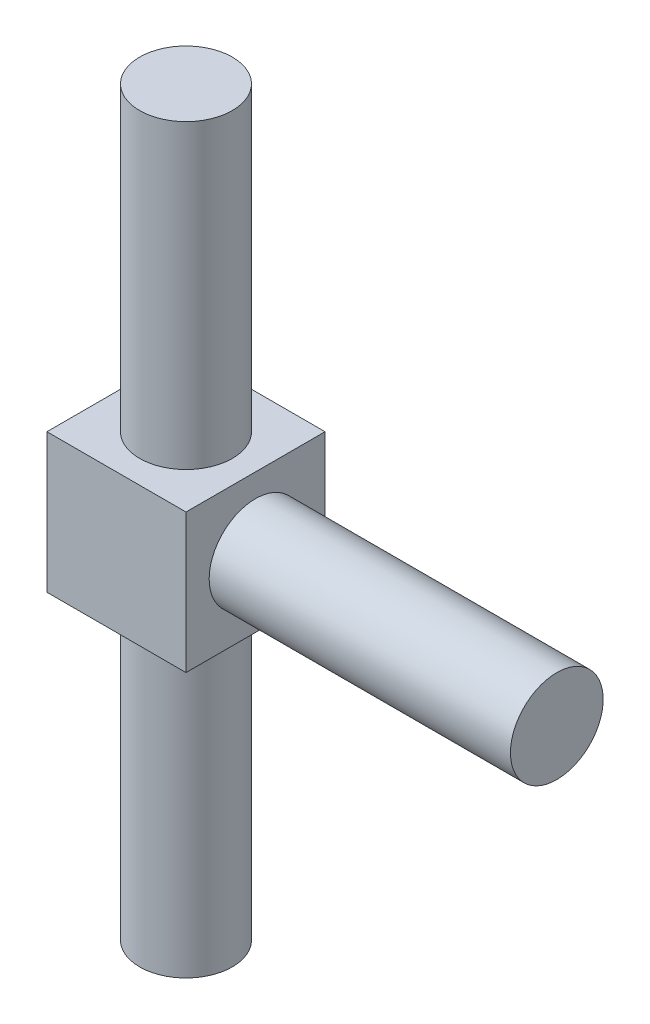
from build123d import *

# Parameters (mm, degrees)
SKETCH_1_W      = 6
SKETCH_1_H      = 6
EXTRUDE_1_DEPTH = 6
SKETCH_2_R      = 2
EXTRUDE_2_DEPTH = 13
EXTRUDE_START   = 13
EXTRUDE_3_DEPTH = 13
EXTRUDE_4_DEPTH = 13


with BuildPart() as part:
    # Sketch 1 → Extrude 1 (new body)
    with BuildSketch(Plane(origin=(0, 0, 0), x_dir=(1, 0, 0), z_dir=(0, 1, 0))):
        with Locations((3, 3)):
            Rectangle(SKETCH_1_W, SKETCH_1_H)
    extrude(amount=EXTRUDE_1_DEPTH)

    # Sketch 2 → Extrude 2 (add)
    with BuildSketch(Plane(origin=(0, 6, 0), x_dir=(1, 0, 0), z_dir=(0, 1, 0))):
        with Locations(Location((3, 3, 0), (0, 0, 90))):
            Circle(SKETCH_2_R)
    extrude(amount=EXTRUDE_2_DEPTH)

    # Sketch 3 → Extrude 3 (add)
    with BuildSketch(Plane.XZ.offset(EXTRUDE_START)):
        with BuildLine():
            ThreePointArc((4.414213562, -1.585786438), (1.585786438, -1.585786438), (1.585786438, -4.414213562))
            Line((1.585786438, -4.414213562), (4.414213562, -1.585786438))
        make_face()
        with BuildLine():
            Line((4.414213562, -1.585786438), (1.585786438, -4.414213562))
            ThreePointArc((1.585786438, -4.414213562), (3.765366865, -4.847759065), (5, -3))
            ThreePointArc((5, -3), (4.847759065, -2.234633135), (4.414213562, -1.585786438))
        make_face()
        with BuildLine():
            ThreePointArc((4.414213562, -1.585786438), (1.585786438, -1.585786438), (1.585786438, -4.414213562))
            Line((1.585786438, -4.414213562), (4.414213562, -1.585786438))
        make_face()
        with BuildLine():
            Line((4.414213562, -1.585786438), (1.585786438, -4.414213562))
            ThreePointArc((1.585786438, -4.414213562), (3.765366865, -4.847759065), (5, -3))
            ThreePointArc((5, -3), (4.847759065, -2.234633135), (4.414213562, -1.585786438))
        make_face()
    extrude(amount=-EXTRUDE_3_DEPTH)

    # Sketch 4 → Extrude 4 (add)
    with BuildSketch(Plane(origin=(6, 0, 0), x_dir=(0, 0, -1), z_dir=(1, 0, 0))):
        with BuildLine():
            ThreePointArc((5, 3), (4.847759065, 3.765366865), (4.414213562, 4.414213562))
            Line((4.414213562, 4.414213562), (1.585786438, 1.585786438))
            ThreePointArc((1.585786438, 1.585786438), (3.765366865, 1.152240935), (5, 3))
        make_face()
        with BuildLine():
            Line((1.585786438, 1.585786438), (4.414213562, 4.414213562))
            ThreePointArc((4.414213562, 4.414213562), (1.585786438, 4.414213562), (1.585786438, 1.585786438))
        make_face()
        with BuildLine():
            ThreePointArc((5, 3), (4.847759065, 3.765366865), (4.414213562, 4.414213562))
            Line((4.414213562, 4.414213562), (1.585786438, 1.585786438))
            ThreePointArc((1.585786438, 1.585786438), (3.765366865, 1.152240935), (5, 3))
        make_face()
        with BuildLine():
            Line((1.585786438, 1.585786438), (4.414213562, 4.414213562))
            ThreePointArc((4.414213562, 4.414213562), (1.585786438, 4.414213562), (1.585786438, 1.585786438))
        make_face()
    extrude(amount=EXTRUDE_4_DEPTH)


solid = part.part
